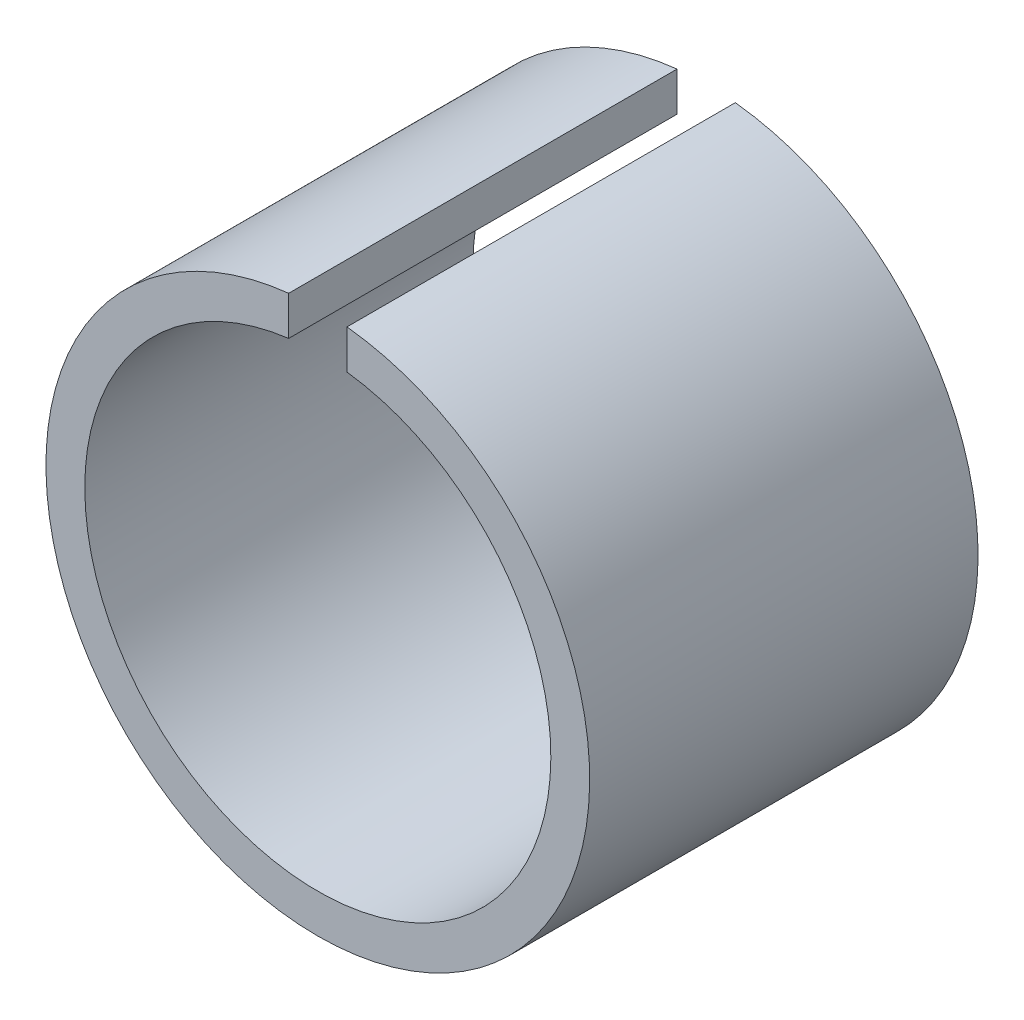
ISO-10303-21;
HEADER;
FILE_DESCRIPTION(('STEP AP214'),'2;1');
FILE_NAME('part.step','',(''),(''),'','','');
FILE_SCHEMA(('AUTOMOTIVE_DESIGN { 1 0 10303 214 1 1 1 1 }'));
ENDSEC;
DATA;
#1=APPLICATION_CONTEXT('core data for automotive mechanical design processes');
#2=APPLICATION_PROTOCOL_DEFINITION('international standard','automotive_design',2000,#1);
#3=PRODUCT_CONTEXT('',#1,'mechanical');
#4=PRODUCT('Part','Part','',(#3));
#5=PRODUCT_RELATED_PRODUCT_CATEGORY('part','',(#4));
#6=PRODUCT_DEFINITION_FORMATION('','',#4);
#7=PRODUCT_DEFINITION_CONTEXT('part definition',#1,'design');
#8=PRODUCT_DEFINITION('design','',#6,#7);
#9=PRODUCT_DEFINITION_SHAPE('','',#8);
#10=(LENGTH_UNIT() NAMED_UNIT(*) SI_UNIT(.MILLI.,.METRE.));
#11=(NAMED_UNIT(*) PLANE_ANGLE_UNIT() SI_UNIT($,.RADIAN.));
#12=(NAMED_UNIT(*) SI_UNIT($,.STERADIAN.) SOLID_ANGLE_UNIT());
#13=UNCERTAINTY_MEASURE_WITH_UNIT(LENGTH_MEASURE(1.E-05),#10,'distance_accuracy_value','');
#14=(GEOMETRIC_REPRESENTATION_CONTEXT(3) GLOBAL_UNCERTAINTY_ASSIGNED_CONTEXT((#13)) GLOBAL_UNIT_ASSIGNED_CONTEXT((#10,
#11,#12)) REPRESENTATION_CONTEXT('',''));
#15=CARTESIAN_POINT('',(0.,0.,0.));
#16=DIRECTION('',(0.,0.,1.));
#17=DIRECTION('',(1.,0.,0.));
#18=AXIS2_PLACEMENT_3D('',#15,#16,#17);
#19=CARTESIAN_POINT('',(0.750000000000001,10.5003856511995,-15.));
#20=DIRECTION('',(1.,0.,0.));
#21=DIRECTION('',(0.,1.,0.));
#22=AXIS2_PLACEMENT_3D('',#19,#20,#21);
#23=PLANE('',#22);
#24=DIRECTION('',(0.,0.,-1.));
#25=VECTOR('',#24,1.);
#26=CARTESIAN_POINT('',(0.750000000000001,5.95294044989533,5.));
#27=LINE('',#26,#25);
#28=CARTESIAN_POINT('',(0.750000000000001,5.95294044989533,-5.));
#29=VERTEX_POINT('',#28);
#30=CARTESIAN_POINT('',(0.750000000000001,5.95294044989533,5.));
#31=VERTEX_POINT('',#30);
#32=EDGE_CURVE('E71',#29,#31,#27,.F.);
#33=ORIENTED_EDGE('',*,*,#32,.T.);
#34=DIRECTION('',(0.,1.,0.));
#35=VECTOR('',#34,1.);
#36=CARTESIAN_POINT('',(0.750000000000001,10.5003856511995,5.));
#37=LINE('',#36,#35);
#38=CARTESIAN_POINT('',(0.750000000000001,6.95970545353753,5.));
#39=VERTEX_POINT('',#38);
#40=EDGE_CURVE('E58',#39,#31,#37,.F.);
#41=ORIENTED_EDGE('',*,*,#40,.F.);
#42=DIRECTION('',(0.,0.,-1.));
#43=VECTOR('',#42,1.);
#44=CARTESIAN_POINT('',(0.750000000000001,6.95970545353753,5.));
#45=LINE('',#44,#43);
#46=CARTESIAN_POINT('',(0.750000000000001,6.95970545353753,-5.));
#47=VERTEX_POINT('',#46);
#48=EDGE_CURVE('E70',#47,#39,#45,.F.);
#49=ORIENTED_EDGE('',*,*,#48,.F.);
#50=DIRECTION('',(0.,1.,0.));
#51=VECTOR('',#50,1.);
#52=CARTESIAN_POINT('',(0.750000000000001,10.5003856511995,-5.));
#53=LINE('',#52,#51);
#54=EDGE_CURVE('E72',#29,#47,#53,.T.);
#55=ORIENTED_EDGE('',*,*,#54,.F.);
#56=EDGE_LOOP('',(#33,#41,#49,#55));
#57=FACE_BOUND('',#56,.T.);
#58=ADVANCED_FACE('F16',(#57),#23,.F.);
#59=CARTESIAN_POINT('',(-0.749999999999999,10.5003856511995,-15.));
#60=DIRECTION('',(-1.,0.,0.));
#61=DIRECTION('',(0.,-1.,0.));
#62=AXIS2_PLACEMENT_3D('',#59,#60,#61);
#63=PLANE('',#62);
#64=DIRECTION('',(0.,0.,-1.));
#65=VECTOR('',#64,1.);
#66=CARTESIAN_POINT('',(-0.749999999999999,5.95294044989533,5.));
#67=LINE('',#66,#65);
#68=CARTESIAN_POINT('',(-0.749999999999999,5.95294044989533,5.));
#69=VERTEX_POINT('',#68);
#70=CARTESIAN_POINT('',(-0.749999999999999,5.95294044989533,-5.));
#71=VERTEX_POINT('',#70);
#72=EDGE_CURVE('E75',#69,#71,#67,.T.);
#73=ORIENTED_EDGE('',*,*,#72,.T.);
#74=DIRECTION('',(0.,-1.,0.));
#75=VECTOR('',#74,1.);
#76=CARTESIAN_POINT('',(-0.749999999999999,10.5003856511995,-5.));
#77=LINE('',#76,#75);
#78=CARTESIAN_POINT('',(-0.749999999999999,6.95970545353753,-5.));
#79=VERTEX_POINT('',#78);
#80=EDGE_CURVE('E82',#79,#71,#77,.T.);
#81=ORIENTED_EDGE('',*,*,#80,.F.);
#82=DIRECTION('',(0.,0.,-1.));
#83=VECTOR('',#82,1.);
#84=CARTESIAN_POINT('',(-0.749999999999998,6.95970545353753,5.));
#85=LINE('',#84,#83);
#86=CARTESIAN_POINT('',(-0.749999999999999,6.95970545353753,5.));
#87=VERTEX_POINT('',#86);
#88=EDGE_CURVE('E85',#87,#79,#85,.T.);
#89=ORIENTED_EDGE('',*,*,#88,.F.);
#90=DIRECTION('',(0.,1.,0.));
#91=VECTOR('',#90,1.);
#92=CARTESIAN_POINT('',(-0.749999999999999,0.,5.));
#93=LINE('',#92,#91);
#94=EDGE_CURVE('E60',#69,#87,#93,.T.);
#95=ORIENTED_EDGE('',*,*,#94,.F.);
#96=EDGE_LOOP('',(#73,#81,#89,#95));
#97=FACE_BOUND('',#96,.T.);
#98=ADVANCED_FACE('F88',(#97),#63,.F.);
#99=CARTESIAN_POINT('',(0.,0.,5.));
#100=DIRECTION('',(0.,0.,-1.));
#101=DIRECTION('',(-1.,0.,0.));
#102=AXIS2_PLACEMENT_3D('',#99,#100,#101);
#103=CYLINDRICAL_SURFACE('',#102,6.);
#104=CARTESIAN_POINT('',(0.,0.,5.));
#105=DIRECTION('',(0.,0.,-1.));
#106=DIRECTION('',(-1.,0.,0.));
#107=AXIS2_PLACEMENT_3D('',#104,#105,#106);
#108=CIRCLE('',#107,6.);
#109=EDGE_CURVE('E19',#31,#69,#108,.T.);
#110=ORIENTED_EDGE('',*,*,#109,.F.);
#111=ORIENTED_EDGE('',*,*,#32,.F.);
#112=CARTESIAN_POINT('',(0.,0.,-5.));
#113=DIRECTION('',(0.,0.,-1.));
#114=DIRECTION('',(-1.,0.,0.));
#115=AXIS2_PLACEMENT_3D('',#112,#113,#114);
#116=CIRCLE('',#115,6.);
#117=EDGE_CURVE('E65',#29,#71,#116,.T.);
#118=ORIENTED_EDGE('',*,*,#117,.T.);
#119=ORIENTED_EDGE('',*,*,#72,.F.);
#120=EDGE_LOOP('',(#110,#111,#118,#119));
#121=FACE_BOUND('',#120,.T.);
#122=ADVANCED_FACE('F90',(#121),#103,.F.);
#123=CARTESIAN_POINT('',(0.,0.,5.));
#124=DIRECTION('',(0.,0.,1.));
#125=DIRECTION('',(1.,0.,0.));
#126=AXIS2_PLACEMENT_3D('',#123,#124,#125);
#127=PLANE('',#126);
#128=ORIENTED_EDGE('',*,*,#40,.T.);
#129=ORIENTED_EDGE('',*,*,#109,.T.);
#130=ORIENTED_EDGE('',*,*,#94,.T.);
#131=CARTESIAN_POINT('',(0.,0.,5.));
#132=DIRECTION('',(0.,0.,-1.));
#133=DIRECTION('',(-1.,0.,0.));
#134=AXIS2_PLACEMENT_3D('',#131,#132,#133);
#135=CIRCLE('',#134,7.);
#136=EDGE_CURVE('E25',#39,#87,#135,.T.);
#137=ORIENTED_EDGE('',*,*,#136,.F.);
#138=EDGE_LOOP('',(#128,#129,#130,#137));
#139=FACE_BOUND('',#138,.T.);
#140=ADVANCED_FACE('F57',(#139),#127,.T.);
#141=CARTESIAN_POINT('',(0.,0.,-5.));
#142=DIRECTION('',(0.,0.,1.));
#143=DIRECTION('',(1.,0.,0.));
#144=AXIS2_PLACEMENT_3D('',#141,#142,#143);
#145=PLANE('',#144);
#146=ORIENTED_EDGE('',*,*,#80,.T.);
#147=ORIENTED_EDGE('',*,*,#117,.F.);
#148=ORIENTED_EDGE('',*,*,#54,.T.);
#149=CARTESIAN_POINT('',(0.,0.,-5.));
#150=DIRECTION('',(0.,0.,-1.));
#151=DIRECTION('',(-1.,0.,0.));
#152=AXIS2_PLACEMENT_3D('',#149,#150,#151);
#153=CIRCLE('',#152,7.);
#154=EDGE_CURVE('E11',#79,#47,#153,.F.);
#155=ORIENTED_EDGE('',*,*,#154,.F.);
#156=EDGE_LOOP('',(#146,#147,#148,#155));
#157=FACE_BOUND('',#156,.T.);
#158=ADVANCED_FACE('F89',(#157),#145,.F.);
#159=CARTESIAN_POINT('',(0.,0.,5.));
#160=DIRECTION('',(0.,0.,-1.));
#161=DIRECTION('',(-1.,0.,0.));
#162=AXIS2_PLACEMENT_3D('',#159,#160,#161);
#163=CYLINDRICAL_SURFACE('',#162,7.);
#164=ORIENTED_EDGE('',*,*,#136,.T.);
#165=ORIENTED_EDGE('',*,*,#88,.T.);
#166=ORIENTED_EDGE('',*,*,#154,.T.);
#167=ORIENTED_EDGE('',*,*,#48,.T.);
#168=EDGE_LOOP('',(#164,#165,#166,#167));
#169=FACE_BOUND('',#168,.T.);
#170=ADVANCED_FACE('F74',(#169),#163,.T.);
#171=CLOSED_SHELL('',(#58,#98,#122,#140,#158,#170));
#172=MANIFOLD_SOLID_BREP('B1',#171);
#173=ADVANCED_BREP_SHAPE_REPRESENTATION('',(#18,#172),#14);
#174=SHAPE_DEFINITION_REPRESENTATION(#9,#173);
ENDSEC;
END-ISO-10303-21;
